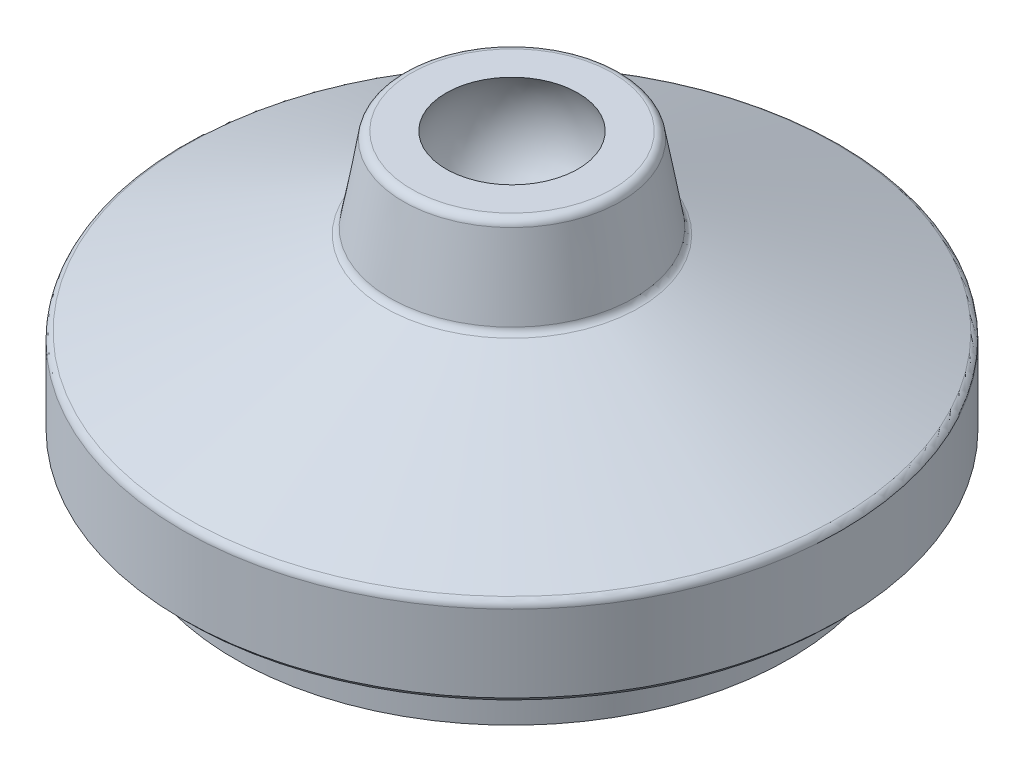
ISO-10303-21;
HEADER;
FILE_DESCRIPTION(('STEP AP214'),'2;1');
FILE_NAME('part.step','',(''),(''),'','','');
FILE_SCHEMA(('AUTOMOTIVE_DESIGN { 1 0 10303 214 1 1 1 1 }'));
ENDSEC;
DATA;
#1=APPLICATION_CONTEXT('core data for automotive mechanical design processes');
#2=APPLICATION_PROTOCOL_DEFINITION('international standard','automotive_design',2000,#1);
#3=PRODUCT_CONTEXT('',#1,'mechanical');
#4=PRODUCT('Part','Part','',(#3));
#5=PRODUCT_RELATED_PRODUCT_CATEGORY('part','',(#4));
#6=PRODUCT_DEFINITION_FORMATION('','',#4);
#7=PRODUCT_DEFINITION_CONTEXT('part definition',#1,'design');
#8=PRODUCT_DEFINITION('design','',#6,#7);
#9=PRODUCT_DEFINITION_SHAPE('','',#8);
#10=(LENGTH_UNIT() NAMED_UNIT(*) SI_UNIT(.MILLI.,.METRE.));
#11=(NAMED_UNIT(*) PLANE_ANGLE_UNIT() SI_UNIT($,.RADIAN.));
#12=(NAMED_UNIT(*) SI_UNIT($,.STERADIAN.) SOLID_ANGLE_UNIT());
#13=UNCERTAINTY_MEASURE_WITH_UNIT(LENGTH_MEASURE(1.E-05),#10,'distance_accuracy_value','');
#14=(GEOMETRIC_REPRESENTATION_CONTEXT(3) GLOBAL_UNCERTAINTY_ASSIGNED_CONTEXT((#13)) GLOBAL_UNIT_ASSIGNED_CONTEXT((#10,
#11,#12)) REPRESENTATION_CONTEXT('',''));
#15=CARTESIAN_POINT('',(0.,0.,0.));
#16=DIRECTION('',(0.,0.,1.));
#17=DIRECTION('',(1.,0.,0.));
#18=AXIS2_PLACEMENT_3D('',#15,#16,#17);
#19=CARTESIAN_POINT('',(0.,20.4,0.));
#20=DIRECTION('',(0.,-1.,0.));
#21=DIRECTION('',(-1.,0.,0.));
#22=AXIS2_PLACEMENT_3D('',#19,#20,#21);
#23=SPHERICAL_SURFACE('',#22,7.);
#24=CARTESIAN_POINT('',(0.,24.,0.));
#25=DIRECTION('',(0.,-1.,0.));
#26=DIRECTION('',(0.,0.,-1.));
#27=AXIS2_PLACEMENT_3D('',#24,#25,#26);
#28=CIRCLE('',#27,6.00333240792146);
#29=CARTESIAN_POINT('',(0.,24.,-6.00333240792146));
#30=VERTEX_POINT('',#29);
#31=EDGE_CURVE('E9',#30,#30,#28,.T.);
#32=ORIENTED_EDGE('',*,*,#31,.F.);
#33=EDGE_LOOP('',(#32));
#34=FACE_BOUND('',#33,.T.);
#35=ADVANCED_FACE('F14',(#34),#23,.F.);
#36=CARTESIAN_POINT('',(6.00333240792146,24.,0.));
#37=DIRECTION('',(0.,-1.,0.));
#38=DIRECTION('',(0.,0.,-1.));
#39=AXIS2_PLACEMENT_3D('',#36,#37,#38);
#40=PLANE('',#39);
#41=CARTESIAN_POINT('',(0.,24.,0.));
#42=DIRECTION('',(0.,-1.,0.));
#43=DIRECTION('',(0.,0.,-1.));
#44=AXIS2_PLACEMENT_3D('',#41,#42,#43);
#45=CIRCLE('',#44,9.16005943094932);
#46=CARTESIAN_POINT('',(0.,24.,-9.16005943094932));
#47=VERTEX_POINT('',#46);
#48=EDGE_CURVE('E20',#47,#47,#45,.T.);
#49=ORIENTED_EDGE('',*,*,#48,.F.);
#50=EDGE_LOOP('',(#49));
#51=FACE_BOUND('',#50,.T.);
#52=ORIENTED_EDGE('',*,*,#31,.T.);
#53=EDGE_LOOP('',(#52));
#54=FACE_BOUND('',#53,.T.);
#55=ADVANCED_FACE('F95',(#51,#54),#40,.F.);
#56=CARTESIAN_POINT('',(0.,23.25,0.));
#57=DIRECTION('',(0.,-1.,0.));
#58=DIRECTION('',(0.,0.,-1.));
#59=AXIS2_PLACEMENT_3D('',#56,#57,#58);
#60=TOROIDAL_SURFACE('',#59,9.16005943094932,0.75);
#61=ORIENTED_EDGE('',*,*,#48,.T.);
#62=EDGE_LOOP('',(#61));
#63=FACE_BOUND('',#62,.T.);
#64=CARTESIAN_POINT('',(0.,23.3802361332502,0.));
#65=DIRECTION('',(0.,-1.,0.));
#66=DIRECTION('',(0.,0.,-1.));
#67=AXIS2_PLACEMENT_3D('',#64,#65,#66);
#68=CIRCLE('',#67,9.89866524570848);
#69=CARTESIAN_POINT('',(0.,23.3802361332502,-9.89866524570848));
#70=VERTEX_POINT('',#69);
#71=EDGE_CURVE('E24',#70,#70,#68,.T.);
#72=ORIENTED_EDGE('',*,*,#71,.F.);
#73=EDGE_LOOP('',(#72));
#74=FACE_BOUND('',#73,.T.);
#75=ADVANCED_FACE('F101',(#63,#74),#60,.T.);
#76=CARTESIAN_POINT('',(0.,23.3802361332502,0.));
#77=DIRECTION('',(0.,-1.,0.));
#78=DIRECTION('',(0.,0.,-1.));
#79=AXIS2_PLACEMENT_3D('',#76,#77,#78);
#80=CONICAL_SURFACE('',#79,9.89866524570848,0.174532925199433);
#81=CARTESIAN_POINT('',(0.,16.4006021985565,0.));
#82=DIRECTION('',(0.,-1.,0.));
#83=DIRECTION('',(0.,0.,-1.));
#84=AXIS2_PLACEMENT_3D('',#81,#82,#83);
#85=CIRCLE('',#84,11.1293630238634);
#86=CARTESIAN_POINT('',(0.,16.4006021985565,-11.1293630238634));
#87=VERTEX_POINT('',#86);
#88=EDGE_CURVE('E28',#87,#87,#85,.T.);
#89=ORIENTED_EDGE('',*,*,#88,.F.);
#90=EDGE_LOOP('',(#89));
#91=FACE_BOUND('',#90,.T.);
#92=ORIENTED_EDGE('',*,*,#71,.T.);
#93=EDGE_LOOP('',(#92));
#94=FACE_BOUND('',#93,.T.);
#95=ADVANCED_FACE('F107',(#91,#94),#80,.T.);
#96=CARTESIAN_POINT('',(0.,16.5308383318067,0.));
#97=DIRECTION('',(0.,-1.,0.));
#98=DIRECTION('',(0.,0.,-1.));
#99=AXIS2_PLACEMENT_3D('',#96,#97,#98);
#100=TOROIDAL_SURFACE('',#99,11.8679688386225,0.75);
#101=CARTESIAN_POINT('',(0.,15.8407223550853,0.));
#102=DIRECTION('',(0.,-1.,0.));
#103=DIRECTION('',(0.,0.,-1.));
#104=AXIS2_PLACEMENT_3D('',#101,#102,#103);
#105=CIRCLE('',#104,11.5743024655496);
#106=CARTESIAN_POINT('',(0.,15.8407223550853,-11.5743024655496));
#107=VERTEX_POINT('',#106);
#108=EDGE_CURVE('E33',#107,#107,#105,.T.);
#109=ORIENTED_EDGE('',*,*,#108,.F.);
#110=EDGE_LOOP('',(#109));
#111=FACE_BOUND('',#110,.T.);
#112=ORIENTED_EDGE('',*,*,#88,.T.);
#113=EDGE_LOOP('',(#112));
#114=FACE_BOUND('',#113,.T.);
#115=ADVANCED_FACE('F91',(#111,#114),#100,.F.);
#116=CARTESIAN_POINT('',(0.,15.8407223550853,0.));
#117=DIRECTION('',(0.,-1.,0.));
#118=DIRECTION('',(0.,0.,-1.));
#119=AXIS2_PLACEMENT_3D('',#116,#117,#118);
#120=CONICAL_SURFACE('',#119,11.5743024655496,1.16847522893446);
#121=CARTESIAN_POINT('',(0.,8.19418452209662,0.));
#122=DIRECTION('',(0.,-1.,0.));
#123=DIRECTION('',(0.,0.,-1.));
#124=AXIS2_PLACEMENT_3D('',#121,#122,#123);
#125=CIRCLE('',#124,29.543666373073);
#126=CARTESIAN_POINT('',(0.,8.19418452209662,-29.543666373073));
#127=VERTEX_POINT('',#126);
#128=EDGE_CURVE('E36',#127,#127,#125,.T.);
#129=ORIENTED_EDGE('',*,*,#128,.F.);
#130=EDGE_LOOP('',(#129));
#131=FACE_BOUND('',#130,.T.);
#132=ORIENTED_EDGE('',*,*,#108,.T.);
#133=EDGE_LOOP('',(#132));
#134=FACE_BOUND('',#133,.T.);
#135=ADVANCED_FACE('F83',(#131,#134),#120,.T.);
#136=CARTESIAN_POINT('',(0.,7.50406854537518,0.));
#137=DIRECTION('',(0.,-1.,0.));
#138=DIRECTION('',(0.,0.,-1.));
#139=AXIS2_PLACEMENT_3D('',#136,#137,#138);
#140=TOROIDAL_SURFACE('',#139,29.25,0.75);
#141=ORIENTED_EDGE('',*,*,#128,.T.);
#142=EDGE_LOOP('',(#141));
#143=FACE_BOUND('',#142,.T.);
#144=CARTESIAN_POINT('',(0.,7.50406854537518,0.));
#145=DIRECTION('',(0.,-1.,0.));
#146=DIRECTION('',(0.,0.,-1.));
#147=AXIS2_PLACEMENT_3D('',#144,#145,#146);
#148=CIRCLE('',#147,30.);
#149=CARTESIAN_POINT('',(0.,7.50406854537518,-30.));
#150=VERTEX_POINT('',#149);
#151=EDGE_CURVE('E39',#150,#150,#148,.T.);
#152=ORIENTED_EDGE('',*,*,#151,.F.);
#153=EDGE_LOOP('',(#152));
#154=FACE_BOUND('',#153,.T.);
#155=ADVANCED_FACE('F78',(#143,#154),#140,.T.);
#156=CARTESIAN_POINT('',(0.,-5.,0.));
#157=DIRECTION('',(0.,-1.,0.));
#158=DIRECTION('',(0.,0.,-1.));
#159=AXIS2_PLACEMENT_3D('',#156,#157,#158);
#160=CYLINDRICAL_SURFACE('',#159,30.);
#161=CARTESIAN_POINT('',(0.,0.5,0.));
#162=DIRECTION('',(0.,-1.,0.));
#163=DIRECTION('',(0.,0.,-1.));
#164=AXIS2_PLACEMENT_3D('',#161,#162,#163);
#165=CIRCLE('',#164,30.);
#166=CARTESIAN_POINT('',(0.,0.5,-30.));
#167=VERTEX_POINT('',#166);
#168=EDGE_CURVE('E42',#167,#167,#165,.T.);
#169=ORIENTED_EDGE('',*,*,#168,.F.);
#170=EDGE_LOOP('',(#169));
#171=FACE_BOUND('',#170,.T.);
#172=ORIENTED_EDGE('',*,*,#151,.T.);
#173=EDGE_LOOP('',(#172));
#174=FACE_BOUND('',#173,.T.);
#175=ADVANCED_FACE('F72',(#171,#174),#160,.T.);
#176=CARTESIAN_POINT('',(0.,0.5,0.));
#177=DIRECTION('',(0.,1.,0.));
#178=DIRECTION('',(0.,0.,1.));
#179=AXIS2_PLACEMENT_3D('',#176,#177,#178);
#180=CONICAL_SURFACE('',#179,30.,0.785398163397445);
#181=CARTESIAN_POINT('',(0.,0.,0.));
#182=DIRECTION('',(0.,-1.,0.));
#183=DIRECTION('',(0.,0.,-1.));
#184=AXIS2_PLACEMENT_3D('',#181,#182,#183);
#185=CIRCLE('',#184,29.5);
#186=CARTESIAN_POINT('',(0.,0.,-29.5));
#187=VERTEX_POINT('',#186);
#188=EDGE_CURVE('E45',#187,#187,#185,.T.);
#189=ORIENTED_EDGE('',*,*,#188,.F.);
#190=EDGE_LOOP('',(#189));
#191=FACE_BOUND('',#190,.T.);
#192=ORIENTED_EDGE('',*,*,#168,.T.);
#193=EDGE_LOOP('',(#192));
#194=FACE_BOUND('',#193,.T.);
#195=ADVANCED_FACE('F66',(#191,#194),#180,.T.);
#196=CARTESIAN_POINT('',(29.5,0.,0.));
#197=DIRECTION('',(0.,1.,0.));
#198=DIRECTION('',(0.,0.,1.));
#199=AXIS2_PLACEMENT_3D('',#196,#197,#198);
#200=PLANE('',#199);
#201=CARTESIAN_POINT('',(0.,0.,0.));
#202=DIRECTION('',(0.,-1.,0.));
#203=DIRECTION('',(0.,0.,-1.));
#204=AXIS2_PLACEMENT_3D('',#201,#202,#203);
#205=CIRCLE('',#204,25.25);
#206=CARTESIAN_POINT('',(0.,0.,-25.25));
#207=VERTEX_POINT('',#206);
#208=EDGE_CURVE('E48',#207,#207,#205,.T.);
#209=ORIENTED_EDGE('',*,*,#208,.F.);
#210=EDGE_LOOP('',(#209));
#211=FACE_BOUND('',#210,.T.);
#212=ORIENTED_EDGE('',*,*,#188,.T.);
#213=EDGE_LOOP('',(#212));
#214=FACE_BOUND('',#213,.T.);
#215=ADVANCED_FACE('F60',(#211,#214),#200,.F.);
#216=CARTESIAN_POINT('',(0.,-5.,0.));
#217=DIRECTION('',(0.,-1.,0.));
#218=DIRECTION('',(0.,0.,-1.));
#219=AXIS2_PLACEMENT_3D('',#216,#217,#218);
#220=CYLINDRICAL_SURFACE('',#219,25.25);
#221=CARTESIAN_POINT('',(0.,-5.,0.));
#222=DIRECTION('',(0.,-1.,0.));
#223=DIRECTION('',(0.,0.,-1.));
#224=AXIS2_PLACEMENT_3D('',#221,#222,#223);
#225=CIRCLE('',#224,25.25);
#226=CARTESIAN_POINT('',(0.,-5.,-25.25));
#227=VERTEX_POINT('',#226);
#228=EDGE_CURVE('E51',#227,#227,#225,.T.);
#229=ORIENTED_EDGE('',*,*,#228,.F.);
#230=EDGE_LOOP('',(#229));
#231=FACE_BOUND('',#230,.T.);
#232=ORIENTED_EDGE('',*,*,#208,.T.);
#233=EDGE_LOOP('',(#232));
#234=FACE_BOUND('',#233,.T.);
#235=ADVANCED_FACE('F57',(#231,#234),#220,.T.);
#236=CARTESIAN_POINT('',(25.25,-5.,0.));
#237=DIRECTION('',(0.,1.,0.));
#238=DIRECTION('',(0.,0.,1.));
#239=AXIS2_PLACEMENT_3D('',#236,#237,#238);
#240=PLANE('',#239);
#241=ORIENTED_EDGE('',*,*,#228,.T.);
#242=EDGE_LOOP('',(#241));
#243=FACE_BOUND('',#242,.T.);
#244=ADVANCED_FACE('F55',(#243),#240,.F.);
#245=CLOSED_SHELL('',(#35,#55,#75,#95,#115,#135,#155,#175,#195,#215,#235,#244));
#246=MANIFOLD_SOLID_BREP('B1',#245);
#247=ADVANCED_BREP_SHAPE_REPRESENTATION('',(#18,#246),#14);
#248=SHAPE_DEFINITION_REPRESENTATION(#9,#247);
ENDSEC;
END-ISO-10303-21;
